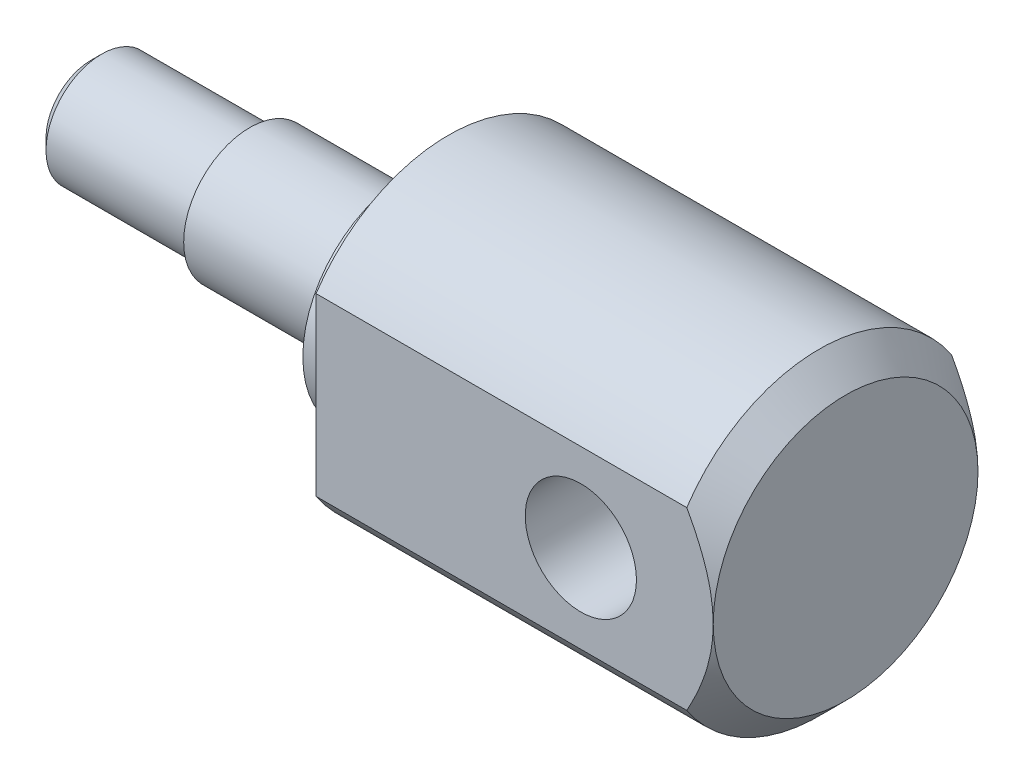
from build123d import *

# Parameters (mm, degrees)
CHAMFER1_SIZE     = 0.4
CHAMFER2_SIZE     = 1
SKETCH2_W         = 20.706007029
SKETCH2_H         = 3.347677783
SKETCH2_H_2       = 2.521090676
EXTRUDE1_DEPTH    = 10
M5_TAPPED_HOLE1_D = 4.2


with BuildPart() as part:
    # Sketch1 → Revolve1 (revolve)
    with BuildSketch(Plane.XY, mode=Mode.PRIVATE) as revolve1_sk:
        Polygon((0, 0), (28.5, 0), (28.5, 6), (13.5, 6), (13.5, 4), (12, 4), (12, 2.5), (6, 2.5), (6, 2.1), (0, 2.1), align=None)
    revolve(revolve1_sk.sketch.rotate(Axis((0, 0, 0), (1, 0, 0)), 90), axis=Axis((0, 0, 0), (1, 0, 0)))

    # Chamfer1
    chamfer1_edges = [part.edges().sort_by_distance(p)[0] for p in [
        (0, 0, -2.1),
    ]]
    chamfer(chamfer1_edges, length=CHAMFER1_SIZE)

    # Chamfer2
    chamfer2_edges = [part.edges().sort_by_distance(p)[0] for p in [
        (28.5, 0, -6),
    ]]
    chamfer(chamfer2_edges, length=CHAMFER2_SIZE)

    # Sketch2 → Extrude1 (cut, symmetric)
    with BuildSketch(Plane(origin=(0, 0, 0), x_dir=(1, 0, 0), z_dir=(0, 1, 0))):
        with Locations((21.048678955, 6.673838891)):
            Rectangle(SKETCH2_W, SKETCH2_H)
        with Locations((21.048678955, -6.260545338)):
            Rectangle(SKETCH2_W, SKETCH2_H_2)
    extrude(amount=EXTRUDE1_DEPTH, both=True, mode=Mode.SUBTRACT)

    # M5 Tapped Hole1 (through all)
    with Locations(Plane(origin=(23.5, 0, 5), x_dir=(1, 0, 0), z_dir=(0, 0, 1))):
        with Locations((0, 0)):
            Hole(M5_TAPPED_HOLE1_D / 2)


solid = part.part
